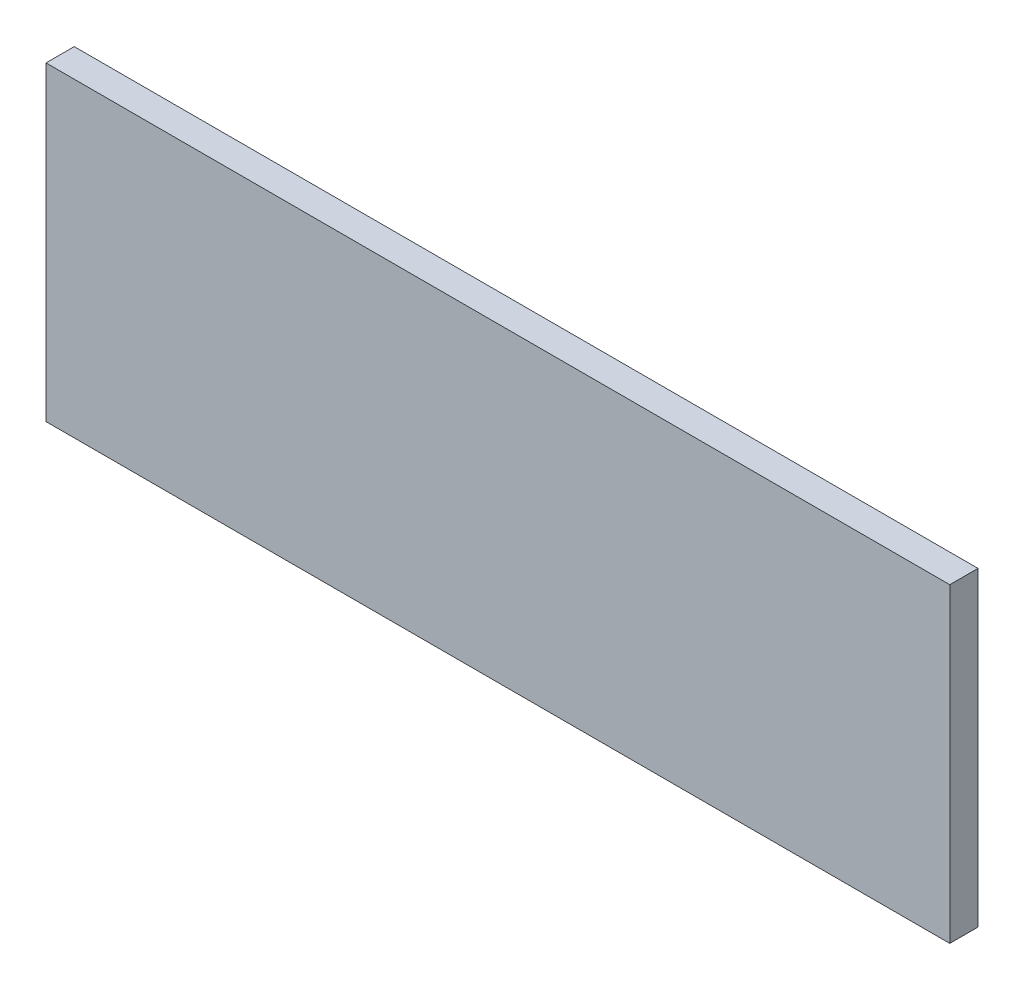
ISO-10303-21;
HEADER;
FILE_DESCRIPTION(('STEP AP214'),'2;1');
FILE_NAME('part.step','',(''),(''),'','','');
FILE_SCHEMA(('AUTOMOTIVE_DESIGN { 1 0 10303 214 1 1 1 1 }'));
ENDSEC;
DATA;
#1=APPLICATION_CONTEXT('core data for automotive mechanical design processes');
#2=APPLICATION_PROTOCOL_DEFINITION('international standard','automotive_design',2000,#1);
#3=PRODUCT_CONTEXT('',#1,'mechanical');
#4=PRODUCT('Part','Part','',(#3));
#5=PRODUCT_RELATED_PRODUCT_CATEGORY('part','',(#4));
#6=PRODUCT_DEFINITION_FORMATION('','',#4);
#7=PRODUCT_DEFINITION_CONTEXT('part definition',#1,'design');
#8=PRODUCT_DEFINITION('design','',#6,#7);
#9=PRODUCT_DEFINITION_SHAPE('','',#8);
#10=(LENGTH_UNIT() NAMED_UNIT(*) SI_UNIT(.MILLI.,.METRE.));
#11=(NAMED_UNIT(*) PLANE_ANGLE_UNIT() SI_UNIT($,.RADIAN.));
#12=(NAMED_UNIT(*) SI_UNIT($,.STERADIAN.) SOLID_ANGLE_UNIT());
#13=UNCERTAINTY_MEASURE_WITH_UNIT(LENGTH_MEASURE(1.E-05),#10,'distance_accuracy_value','');
#14=(GEOMETRIC_REPRESENTATION_CONTEXT(3) GLOBAL_UNCERTAINTY_ASSIGNED_CONTEXT((#13)) GLOBAL_UNIT_ASSIGNED_CONTEXT((#10,
#11,#12)) REPRESENTATION_CONTEXT('',''));
#15=CARTESIAN_POINT('',(0.,0.,0.));
#16=DIRECTION('',(0.,0.,1.));
#17=DIRECTION('',(1.,0.,0.));
#18=AXIS2_PLACEMENT_3D('',#15,#16,#17);
#19=CARTESIAN_POINT('',(-203.2,69.85,12.7));
#20=DIRECTION('',(1.,0.,0.));
#21=DIRECTION('',(0.,1.,0.));
#22=AXIS2_PLACEMENT_3D('',#19,#20,#21);
#23=PLANE('',#22);
#24=DIRECTION('',(0.,-1.,0.));
#25=VECTOR('',#24,1.);
#26=CARTESIAN_POINT('',(-203.2,69.85,0.));
#27=LINE('',#26,#25);
#28=CARTESIAN_POINT('',(-203.2,69.85,0.));
#29=VERTEX_POINT('',#28);
#30=CARTESIAN_POINT('',(-203.2,-69.85,0.));
#31=VERTEX_POINT('',#30);
#32=EDGE_CURVE('E94',#29,#31,#27,.T.);
#33=ORIENTED_EDGE('',*,*,#32,.T.);
#34=DIRECTION('',(0.,0.,-1.));
#35=VECTOR('',#34,1.);
#36=CARTESIAN_POINT('',(-203.2,-69.85,12.7));
#37=LINE('',#36,#35);
#38=CARTESIAN_POINT('',(-203.2,-69.85,12.7));
#39=VERTEX_POINT('',#38);
#40=EDGE_CURVE('E11',#39,#31,#37,.T.);
#41=ORIENTED_EDGE('',*,*,#40,.F.);
#42=DIRECTION('',(0.,-1.,0.));
#43=VECTOR('',#42,1.);
#44=CARTESIAN_POINT('',(-203.2,69.85,12.7));
#45=LINE('',#44,#43);
#46=CARTESIAN_POINT('',(-203.2,69.85,12.7));
#47=VERTEX_POINT('',#46);
#48=EDGE_CURVE('E82',#47,#39,#45,.T.);
#49=ORIENTED_EDGE('',*,*,#48,.F.);
#50=DIRECTION('',(0.,0.,-1.));
#51=VECTOR('',#50,1.);
#52=CARTESIAN_POINT('',(-203.2,69.85,12.7));
#53=LINE('',#52,#51);
#54=EDGE_CURVE('E90',#47,#29,#53,.T.);
#55=ORIENTED_EDGE('',*,*,#54,.T.);
#56=EDGE_LOOP('',(#33,#41,#49,#55));
#57=FACE_BOUND('',#56,.T.);
#58=ADVANCED_FACE('F31',(#57),#23,.F.);
#59=CARTESIAN_POINT('',(-203.2,-69.85,12.7));
#60=DIRECTION('',(0.,1.,0.));
#61=DIRECTION('',(0.,0.,1.));
#62=AXIS2_PLACEMENT_3D('',#59,#60,#61);
#63=PLANE('',#62);
#64=DIRECTION('',(1.,0.,0.));
#65=VECTOR('',#64,1.);
#66=CARTESIAN_POINT('',(-203.2,-69.85,0.));
#67=LINE('',#66,#65);
#68=CARTESIAN_POINT('',(203.2,-69.85,0.));
#69=VERTEX_POINT('',#68);
#70=EDGE_CURVE('E86',#31,#69,#67,.T.);
#71=ORIENTED_EDGE('',*,*,#70,.T.);
#72=DIRECTION('',(0.,0.,-1.));
#73=VECTOR('',#72,1.);
#74=CARTESIAN_POINT('',(203.2,-69.85,12.7));
#75=LINE('',#74,#73);
#76=CARTESIAN_POINT('',(203.2,-69.85,12.7));
#77=VERTEX_POINT('',#76);
#78=EDGE_CURVE('E39',#77,#69,#75,.T.);
#79=ORIENTED_EDGE('',*,*,#78,.F.);
#80=DIRECTION('',(1.,0.,0.));
#81=VECTOR('',#80,1.);
#82=CARTESIAN_POINT('',(-203.2,-69.85,12.7));
#83=LINE('',#82,#81);
#84=EDGE_CURVE('E77',#39,#77,#83,.T.);
#85=ORIENTED_EDGE('',*,*,#84,.F.);
#86=ORIENTED_EDGE('',*,*,#40,.T.);
#87=EDGE_LOOP('',(#71,#79,#85,#86));
#88=FACE_BOUND('',#87,.T.);
#89=ADVANCED_FACE('F85',(#88),#63,.F.);
#90=CARTESIAN_POINT('',(203.2,69.85,12.7));
#91=DIRECTION('',(-1.,0.,0.));
#92=DIRECTION('',(0.,0.,1.));
#93=AXIS2_PLACEMENT_3D('',#90,#91,#92);
#94=PLANE('',#93);
#95=DIRECTION('',(0.,1.,0.));
#96=VECTOR('',#95,1.);
#97=CARTESIAN_POINT('',(203.2,69.85,0.));
#98=LINE('',#97,#96);
#99=CARTESIAN_POINT('',(203.2,69.85,0.));
#100=VERTEX_POINT('',#99);
#101=EDGE_CURVE('E64',#69,#100,#98,.T.);
#102=ORIENTED_EDGE('',*,*,#101,.T.);
#103=DIRECTION('',(0.,0.,-1.));
#104=VECTOR('',#103,1.);
#105=CARTESIAN_POINT('',(203.2,69.85,12.7));
#106=LINE('',#105,#104);
#107=CARTESIAN_POINT('',(203.2,69.85,12.7));
#108=VERTEX_POINT('',#107);
#109=EDGE_CURVE('E87',#108,#100,#106,.T.);
#110=ORIENTED_EDGE('',*,*,#109,.F.);
#111=DIRECTION('',(0.,1.,0.));
#112=VECTOR('',#111,1.);
#113=CARTESIAN_POINT('',(203.2,69.85,12.7));
#114=LINE('',#113,#112);
#115=EDGE_CURVE('E80',#77,#108,#114,.T.);
#116=ORIENTED_EDGE('',*,*,#115,.F.);
#117=ORIENTED_EDGE('',*,*,#78,.T.);
#118=EDGE_LOOP('',(#102,#110,#116,#117));
#119=FACE_BOUND('',#118,.T.);
#120=ADVANCED_FACE('F88',(#119),#94,.F.);
#121=CARTESIAN_POINT('',(-203.2,69.85,12.7));
#122=DIRECTION('',(0.,-1.,0.));
#123=DIRECTION('',(0.,0.,-1.));
#124=AXIS2_PLACEMENT_3D('',#121,#122,#123);
#125=PLANE('',#124);
#126=DIRECTION('',(-1.,0.,0.));
#127=VECTOR('',#126,1.);
#128=CARTESIAN_POINT('',(-203.2,69.85,0.));
#129=LINE('',#128,#127);
#130=EDGE_CURVE('E70',#100,#29,#129,.T.);
#131=ORIENTED_EDGE('',*,*,#130,.T.);
#132=ORIENTED_EDGE('',*,*,#54,.F.);
#133=DIRECTION('',(-1.,0.,0.));
#134=VECTOR('',#133,1.);
#135=CARTESIAN_POINT('',(-203.2,69.85,12.7));
#136=LINE('',#135,#134);
#137=EDGE_CURVE('E47',#108,#47,#136,.T.);
#138=ORIENTED_EDGE('',*,*,#137,.F.);
#139=ORIENTED_EDGE('',*,*,#109,.T.);
#140=EDGE_LOOP('',(#131,#132,#138,#139));
#141=FACE_BOUND('',#140,.T.);
#142=ADVANCED_FACE('F101',(#141),#125,.F.);
#143=CARTESIAN_POINT('',(-203.2,-69.85,12.7));
#144=DIRECTION('',(0.,0.,1.));
#145=DIRECTION('',(1.,0.,0.));
#146=AXIS2_PLACEMENT_3D('',#143,#144,#145);
#147=PLANE('',#146);
#148=ORIENTED_EDGE('',*,*,#48,.T.);
#149=ORIENTED_EDGE('',*,*,#84,.T.);
#150=ORIENTED_EDGE('',*,*,#115,.T.);
#151=ORIENTED_EDGE('',*,*,#137,.T.);
#152=EDGE_LOOP('',(#148,#149,#150,#151));
#153=FACE_BOUND('',#152,.T.);
#154=ADVANCED_FACE('F78',(#153),#147,.T.);
#155=CARTESIAN_POINT('',(-203.2,-69.85,0.));
#156=DIRECTION('',(0.,0.,1.));
#157=DIRECTION('',(1.,0.,0.));
#158=AXIS2_PLACEMENT_3D('',#155,#156,#157);
#159=PLANE('',#158);
#160=ORIENTED_EDGE('',*,*,#32,.F.);
#161=ORIENTED_EDGE('',*,*,#130,.F.);
#162=ORIENTED_EDGE('',*,*,#101,.F.);
#163=ORIENTED_EDGE('',*,*,#70,.F.);
#164=EDGE_LOOP('',(#160,#161,#162,#163));
#165=FACE_BOUND('',#164,.T.);
#166=ADVANCED_FACE('F104',(#165),#159,.F.);
#167=CLOSED_SHELL('',(#58,#89,#120,#142,#154,#166));
#168=MANIFOLD_SOLID_BREP('B2',#167);
#169=ADVANCED_BREP_SHAPE_REPRESENTATION('',(#18,#168),#14);
#170=SHAPE_DEFINITION_REPRESENTATION(#9,#169);
ENDSEC;
END-ISO-10303-21;
